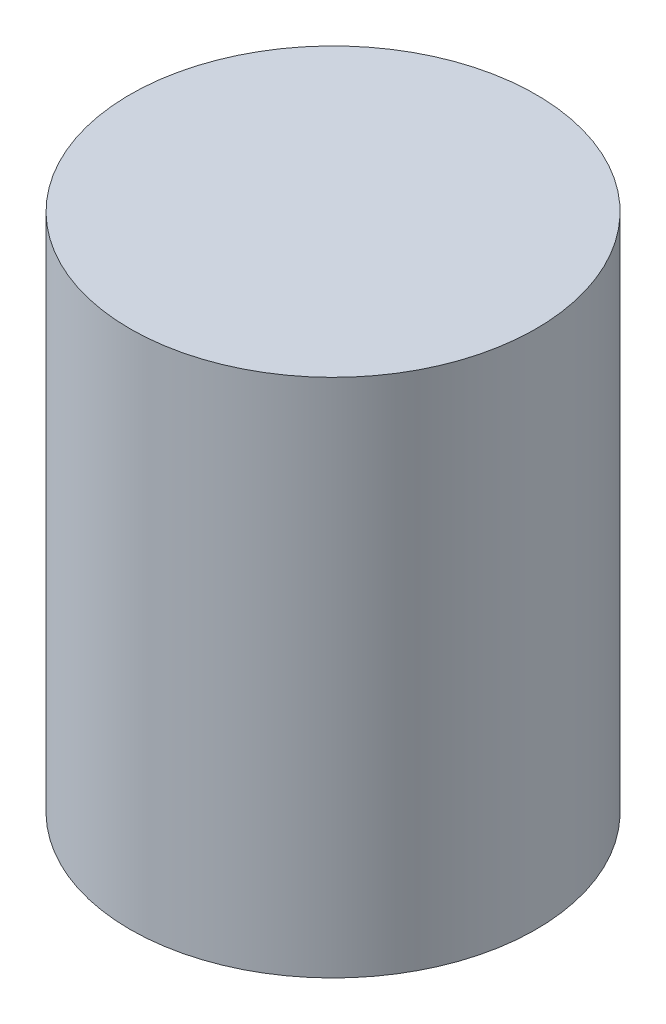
ISO-10303-21;
HEADER;
FILE_DESCRIPTION(('STEP AP214'),'2;1');
FILE_NAME('part.step','',(''),(''),'','','');
FILE_SCHEMA(('AUTOMOTIVE_DESIGN { 1 0 10303 214 1 1 1 1 }'));
ENDSEC;
DATA;
#1=APPLICATION_CONTEXT('core data for automotive mechanical design processes');
#2=APPLICATION_PROTOCOL_DEFINITION('international standard','automotive_design',2000,#1);
#3=PRODUCT_CONTEXT('',#1,'mechanical');
#4=PRODUCT('Part','Part','',(#3));
#5=PRODUCT_RELATED_PRODUCT_CATEGORY('part','',(#4));
#6=PRODUCT_DEFINITION_FORMATION('','',#4);
#7=PRODUCT_DEFINITION_CONTEXT('part definition',#1,'design');
#8=PRODUCT_DEFINITION('design','',#6,#7);
#9=PRODUCT_DEFINITION_SHAPE('','',#8);
#10=(LENGTH_UNIT() NAMED_UNIT(*) SI_UNIT(.MILLI.,.METRE.));
#11=(NAMED_UNIT(*) PLANE_ANGLE_UNIT() SI_UNIT($,.RADIAN.));
#12=(NAMED_UNIT(*) SI_UNIT($,.STERADIAN.) SOLID_ANGLE_UNIT());
#13=UNCERTAINTY_MEASURE_WITH_UNIT(LENGTH_MEASURE(1.E-05),#10,'distance_accuracy_value','');
#14=(GEOMETRIC_REPRESENTATION_CONTEXT(3) GLOBAL_UNCERTAINTY_ASSIGNED_CONTEXT((#13)) GLOBAL_UNIT_ASSIGNED_CONTEXT((#10,
#11,#12)) REPRESENTATION_CONTEXT('',''));
#15=CARTESIAN_POINT('',(0.,0.,0.));
#16=DIRECTION('',(0.,0.,1.));
#17=DIRECTION('',(1.,0.,0.));
#18=AXIS2_PLACEMENT_3D('',#15,#16,#17);
#19=CARTESIAN_POINT('',(68.4136350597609,84.,-83.2359011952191));
#20=DIRECTION('',(0.,-1.,0.));
#21=DIRECTION('',(0.,0.,-1.));
#22=AXIS2_PLACEMENT_3D('',#19,#20,#21);
#23=CYLINDRICAL_SURFACE('',#22,32.7757370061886);
#24=CARTESIAN_POINT('',(68.4136350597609,84.,-83.2359011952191));
#25=DIRECTION('',(0.,1.,0.));
#26=DIRECTION('',(0.,0.,1.));
#27=AXIS2_PLACEMENT_3D('',#24,#25,#26);
#28=CIRCLE('',#27,32.7757370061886);
#29=CARTESIAN_POINT('',(68.4136350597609,84.,-50.4601641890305));
#30=VERTEX_POINT('',#29);
#31=EDGE_CURVE('E10',#30,#30,#28,.T.);
#32=ORIENTED_EDGE('',*,*,#31,.F.);
#33=EDGE_LOOP('',(#32));
#34=FACE_BOUND('',#33,.T.);
#35=CARTESIAN_POINT('',(68.4136350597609,0.,-83.2359011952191));
#36=DIRECTION('',(0.,1.,0.));
#37=DIRECTION('',(0.,0.,1.));
#38=AXIS2_PLACEMENT_3D('',#35,#36,#37);
#39=CIRCLE('',#38,32.7757370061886);
#40=CARTESIAN_POINT('',(68.4136350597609,0.,-50.4601641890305));
#41=VERTEX_POINT('',#40);
#42=EDGE_CURVE('E31',#41,#41,#39,.T.);
#43=ORIENTED_EDGE('',*,*,#42,.T.);
#44=EDGE_LOOP('',(#43));
#45=FACE_BOUND('',#44,.T.);
#46=ADVANCED_FACE('F28',(#34,#45),#23,.T.);
#47=CARTESIAN_POINT('',(68.4136350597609,84.,-83.2359011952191));
#48=DIRECTION('',(0.,1.,0.));
#49=DIRECTION('',(0.,0.,1.));
#50=AXIS2_PLACEMENT_3D('',#47,#48,#49);
#51=PLANE('',#50);
#52=ORIENTED_EDGE('',*,*,#31,.T.);
#53=EDGE_LOOP('',(#52));
#54=FACE_BOUND('',#53,.T.);
#55=ADVANCED_FACE('F43',(#54),#51,.T.);
#56=CARTESIAN_POINT('',(68.4136350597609,0.,-83.2359011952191));
#57=DIRECTION('',(0.,1.,0.));
#58=DIRECTION('',(0.,0.,1.));
#59=AXIS2_PLACEMENT_3D('',#56,#57,#58);
#60=PLANE('',#59);
#61=ORIENTED_EDGE('',*,*,#42,.F.);
#62=EDGE_LOOP('',(#61));
#63=FACE_BOUND('',#62,.T.);
#64=ADVANCED_FACE('F41',(#63),#60,.F.);
#65=CLOSED_SHELL('',(#46,#55,#64));
#66=MANIFOLD_SOLID_BREP('B2',#65);
#67=ADVANCED_BREP_SHAPE_REPRESENTATION('',(#18,#66),#14);
#68=SHAPE_DEFINITION_REPRESENTATION(#9,#67);
ENDSEC;
END-ISO-10303-21;
